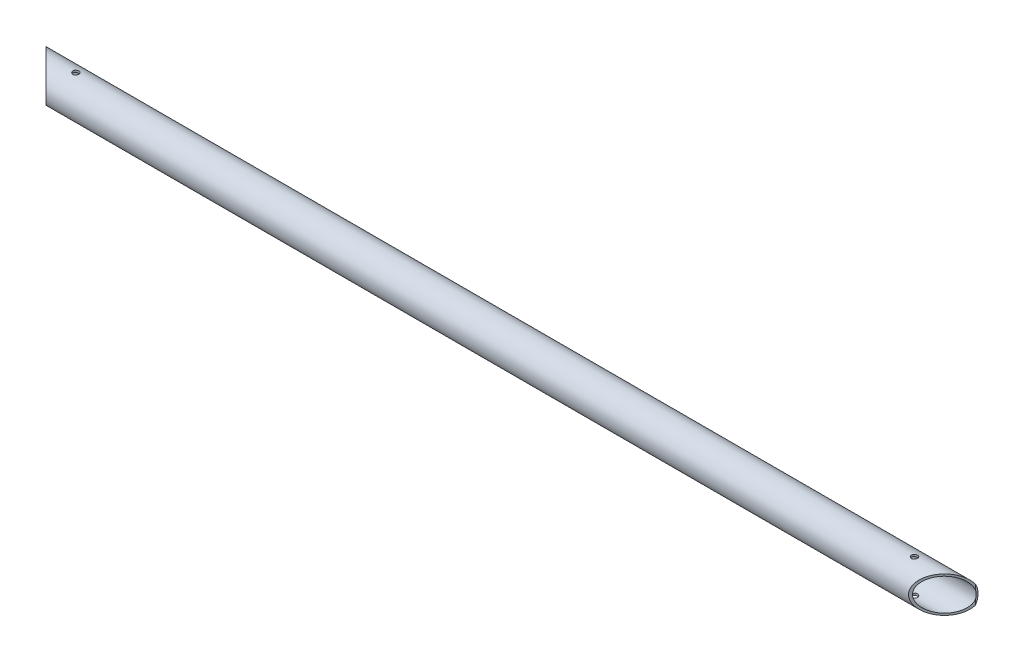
from build123d import *

# Parameters (mm, degrees)
SKETCH1_R          = 19.05
SKETCH1_R_2        = 16.9418
EXTRUDE1_DEPTH     = 495.3
EXTRUDE2_DEPTH     = 497.032151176
EXTRUDE3_DEPTH     = 497.032151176
SKETCH7_R          = 3.175
CUT_EXTRUDE1_DEPTH = 497.032151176


with BuildPart() as part:
    # Sketch1 → Extrude1 (new, symmetric)
    with BuildSketch(Plane(origin=(0, 0, 0), x_dir=(0, 0, -1), z_dir=(1, 0, 0))):
        Circle(SKETCH1_R)
        Circle(SKETCH1_R_2, mode=Mode.SUBTRACT)
    extrude(amount=EXTRUDE1_DEPTH, both=True)

    # Sketch4 → Extrude2 (cut, symmetric)
    with BuildSketch(Plane(origin=(0, 0, 0), x_dir=(1, 0, 0), z_dir=(0, 1, 0))):
        Polygon((-495.3, -19.05), (-457.2, -19.05), (-495.3, 19.05), align=None)
    extrude2 = extrude(amount=EXTRUDE2_DEPTH, both=True, mode=Mode.SUBTRACT)

    # Mirror1: Extrude2 across plane
    add(extrude2.mirror(Plane(origin=(0, 0, 0), x_dir=(0, 0, 1), z_dir=(1, 0, 0))), mode=Mode.SUBTRACT)

    # Sketch6 → Extrude3 (cut, symmetric)
    with BuildSketch(Plane(origin=(0, 0, 0), x_dir=(1, 0, 0), z_dir=(0, 1, 0))):
        Polygon((-492.76, 19.05), (-495.3, 19.05), (-492.76, 16.51), align=None)
    extrude3 = extrude(amount=EXTRUDE3_DEPTH, both=True, mode=Mode.SUBTRACT)

    # Sketch7 → Cut-Extrude1 (cut, symmetric)
    with BuildSketch(Plane(origin=(0, 0, 0), x_dir=(1, 0, 0), z_dir=(0, 1, 0))):
        with Locations(Location((444.5, 0, 0), (0, 0, 90))):
            Circle(SKETCH7_R)
    cut_extrude1 = extrude(amount=CUT_EXTRUDE1_DEPTH, both=True, mode=Mode.SUBTRACT)

    # Mirror2: Extrude3 across plane
    add(extrude3.mirror(Plane(origin=(0, 0, 0), x_dir=(0, 0, 1), z_dir=(1, 0, 0))), mode=Mode.SUBTRACT)

    # Mirror3: Cut-Extrude1 across plane
    add(cut_extrude1.mirror(Plane(origin=(0, 0, 0), x_dir=(0, 0, 1), z_dir=(1, 0, 0))), mode=Mode.SUBTRACT)


solid = part.part
